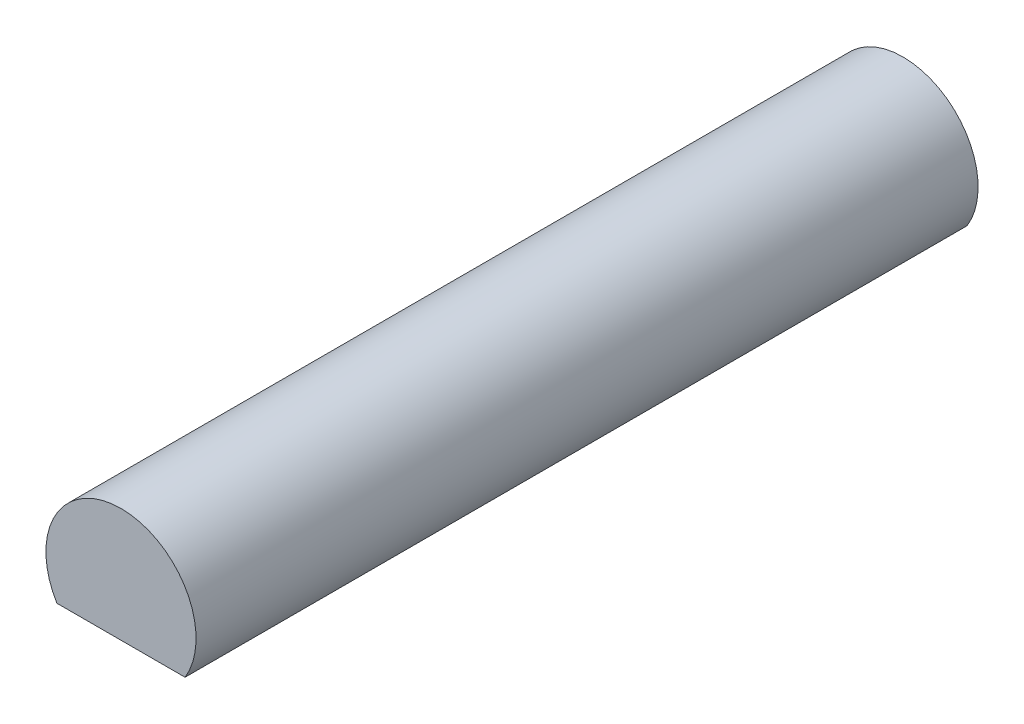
from build123d import *

# Parameters (mm, degrees)
BOSS_EXTRUDE1_DEPTH = 25


with BuildPart() as part:
    # Sketch1 → Boss-Extrude1 (new body)
    with BuildSketch(Plane.XY):
        with BuildLine():
            Line((-2.048780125, -1.25), (2.048780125, -1.25))
            ThreePointArc((2.048780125, -1.25), (0, 2.4), (-2.048780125, -1.25))
        make_face()
    extrude(amount=BOSS_EXTRUDE1_DEPTH)


solid = part.part
